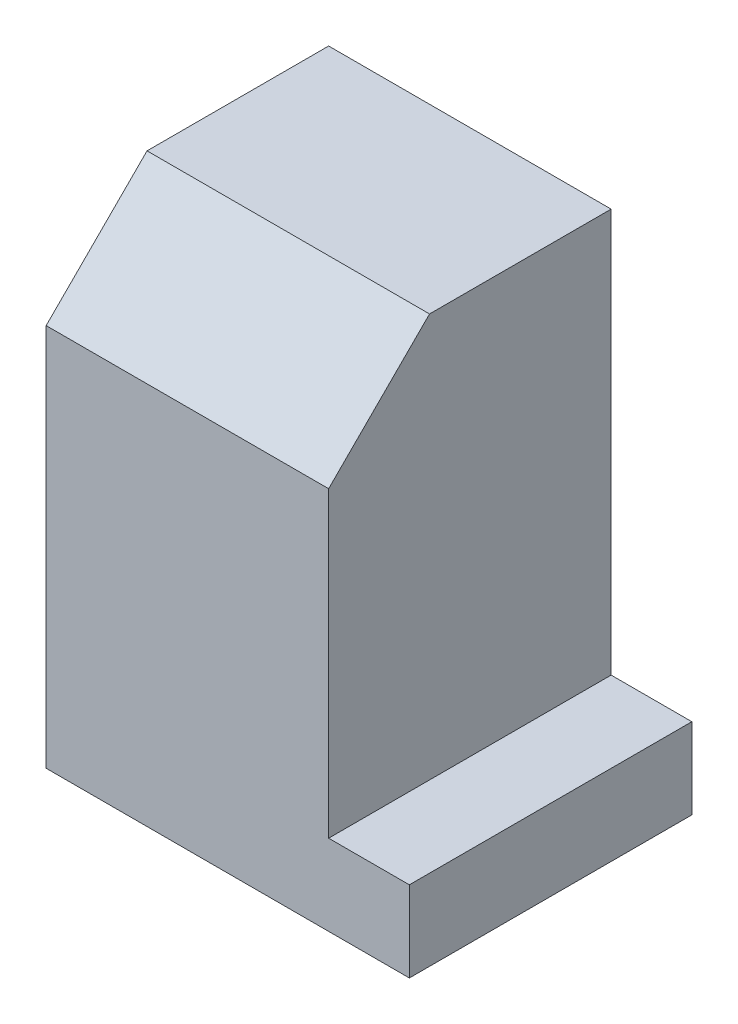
from build123d import *

# Parameters (mm, degrees)
EXTRUDE_1_DEPTH     = 70
CUT_EXTRUDE_1_DEPTH = 156.563491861


with BuildPart() as part:
    # Sketch 1 → Extrude 1 (new body)
    with BuildSketch(Plane.XY):
        Polygon((0, 0), (90, 0), (90, 20), (70, 20), (70, 120), (0, 120), align=None)
    extrude(amount=EXTRUDE_1_DEPTH)

    # Sketch 2 → Cut-Extrude 1 (cut, through all)
    with BuildSketch(Plane(origin=(70, 0, 0), x_dir=(0, 0, -1), z_dir=(1, 0, 0))):
        Polygon((-45, 120), (-70, 95), (-70, 120), align=None)
    extrude(amount=-CUT_EXTRUDE_1_DEPTH, mode=Mode.SUBTRACT)


solid = part.part
